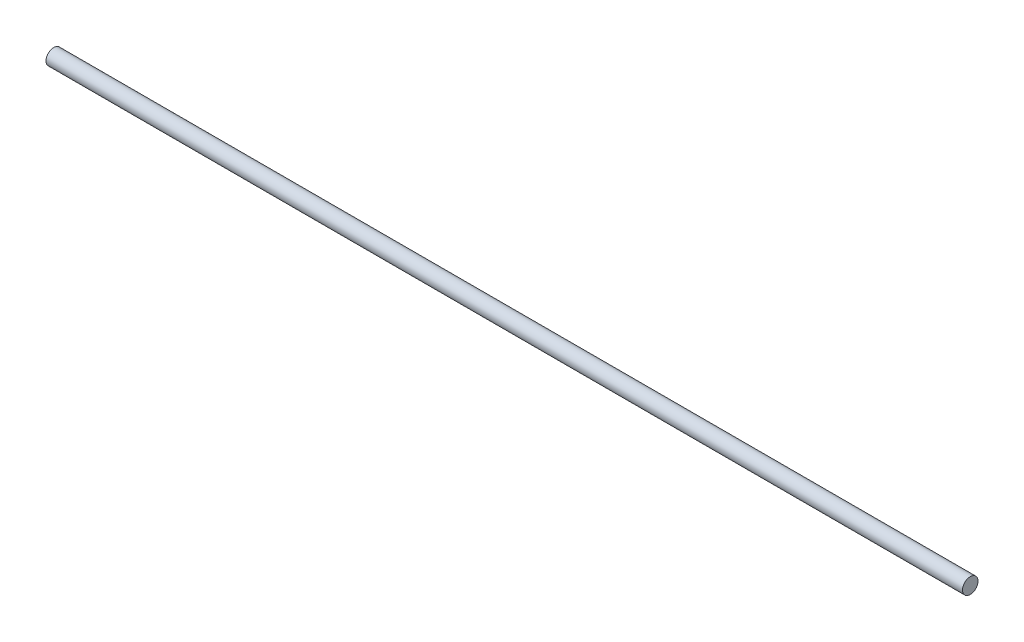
from build123d import *

# Parameters (mm, degrees)
SKIZZE1_W = 649.711449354
SKIZZE1_H = 5.5


with BuildPart() as part:
    # Skizze1 → Rotation1 (revolve)
    with BuildSketch(Plane.XY, mode=Mode.PRIVATE) as rotation1_sk:
        with Locations((6.904350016, -2.75)):
            Rectangle(SKIZZE1_W, SKIZZE1_H)
    revolve(rotation1_sk.sketch.rotate(Axis((-430.52956641, 0, 0), (1, 0, 0)), 270), axis=Axis((-430.52956641, 0, 0), (1, 0, 0)))


solid = part.part
